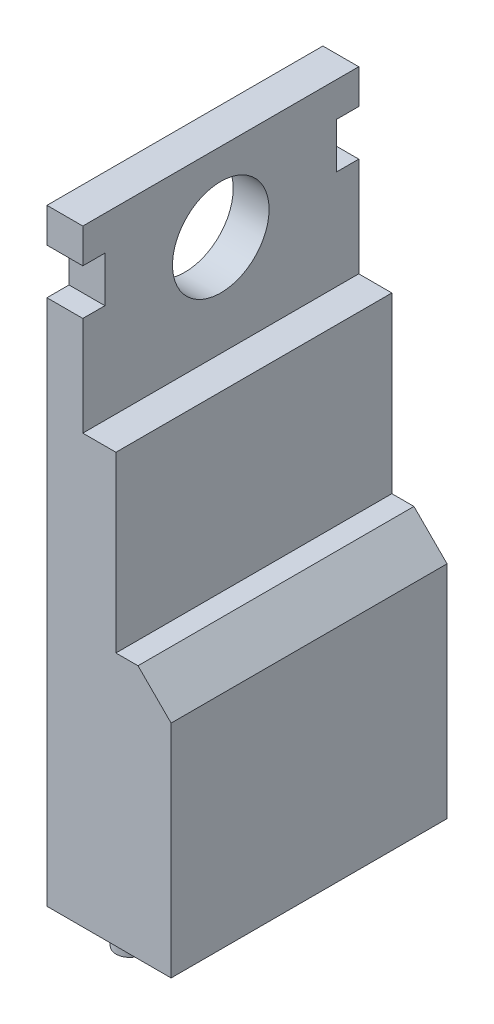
ISO-10303-21;
HEADER;
FILE_DESCRIPTION(('STEP AP214'),'2;1');
FILE_NAME('part.step','',(''),(''),'','','');
FILE_SCHEMA(('AUTOMOTIVE_DESIGN { 1 0 10303 214 1 1 1 1 }'));
ENDSEC;
DATA;
#1=APPLICATION_CONTEXT('core data for automotive mechanical design processes');
#2=APPLICATION_PROTOCOL_DEFINITION('international standard','automotive_design',2000,#1);
#3=PRODUCT_CONTEXT('',#1,'mechanical');
#4=PRODUCT('Part','Part','',(#3));
#5=PRODUCT_RELATED_PRODUCT_CATEGORY('part','',(#4));
#6=PRODUCT_DEFINITION_FORMATION('','',#4);
#7=PRODUCT_DEFINITION_CONTEXT('part definition',#1,'design');
#8=PRODUCT_DEFINITION('design','',#6,#7);
#9=PRODUCT_DEFINITION_SHAPE('','',#8);
#10=(LENGTH_UNIT() NAMED_UNIT(*) SI_UNIT(.MILLI.,.METRE.));
#11=(NAMED_UNIT(*) PLANE_ANGLE_UNIT() SI_UNIT($,.RADIAN.));
#12=(NAMED_UNIT(*) SI_UNIT($,.STERADIAN.) SOLID_ANGLE_UNIT());
#13=UNCERTAINTY_MEASURE_WITH_UNIT(LENGTH_MEASURE(1.E-05),#10,'distance_accuracy_value','');
#14=(GEOMETRIC_REPRESENTATION_CONTEXT(3) GLOBAL_UNCERTAINTY_ASSIGNED_CONTEXT((#13)) GLOBAL_UNIT_ASSIGNED_CONTEXT((#10,
#11,#12)) REPRESENTATION_CONTEXT('',''));
#15=CARTESIAN_POINT('',(0.,0.,0.));
#16=DIRECTION('',(0.,0.,1.));
#17=DIRECTION('',(1.,0.,0.));
#18=AXIS2_PLACEMENT_3D('',#15,#16,#17);
#19=CARTESIAN_POINT('',(1.3,19.15,0.));
#20=DIRECTION('',(-1.,0.,0.));
#21=DIRECTION('',(0.,0.,1.));
#22=AXIS2_PLACEMENT_3D('',#19,#20,#21);
#23=CYLINDRICAL_SURFACE('',#22,1.75);
#24=CARTESIAN_POINT('',(0.,19.15,0.));
#25=DIRECTION('',(1.,0.,0.));
#26=DIRECTION('',(0.,0.,-1.));
#27=AXIS2_PLACEMENT_3D('',#24,#25,#26);
#28=CIRCLE('',#27,1.75);
#29=CARTESIAN_POINT('',(0.,19.15,-1.75));
#30=VERTEX_POINT('',#29);
#31=EDGE_CURVE('E293',#30,#30,#28,.T.);
#32=ORIENTED_EDGE('',*,*,#31,.F.);
#33=EDGE_LOOP('',(#32));
#34=FACE_BOUND('',#33,.T.);
#35=CARTESIAN_POINT('',(1.3,19.15,0.));
#36=DIRECTION('',(1.,0.,0.));
#37=DIRECTION('',(0.,0.,-1.));
#38=AXIS2_PLACEMENT_3D('',#35,#36,#37);
#39=CIRCLE('',#38,1.75);
#40=CARTESIAN_POINT('',(1.3,19.15,-1.75));
#41=VERTEX_POINT('',#40);
#42=EDGE_CURVE('E11',#41,#41,#39,.T.);
#43=ORIENTED_EDGE('',*,*,#42,.T.);
#44=EDGE_LOOP('',(#43));
#45=FACE_BOUND('',#44,.T.);
#46=ADVANCED_FACE('F17',(#34,#45),#23,.F.);
#47=CARTESIAN_POINT('',(1.5,-1.25,-3.5));
#48=DIRECTION('',(0.,1.,0.));
#49=DIRECTION('',(-1.,0.,0.));
#50=AXIS2_PLACEMENT_3D('',#47,#48,#49);
#51=CYLINDRICAL_SURFACE('',#50,0.5);
#52=CARTESIAN_POINT('',(1.5,0.,-3.5));
#53=DIRECTION('',(0.,-1.,0.));
#54=DIRECTION('',(-1.,0.,0.));
#55=AXIS2_PLACEMENT_3D('',#52,#53,#54);
#56=CIRCLE('',#55,0.5);
#57=CARTESIAN_POINT('',(1.,0.,-3.5));
#58=VERTEX_POINT('',#57);
#59=EDGE_CURVE('E27',#58,#58,#56,.T.);
#60=ORIENTED_EDGE('',*,*,#59,.T.);
#61=EDGE_LOOP('',(#60));
#62=FACE_BOUND('',#61,.T.);
#63=CARTESIAN_POINT('',(1.5,-1.25,-3.5));
#64=DIRECTION('',(0.,-1.,0.));
#65=DIRECTION('',(-1.,0.,0.));
#66=AXIS2_PLACEMENT_3D('',#63,#64,#65);
#67=CIRCLE('',#66,0.5);
#68=CARTESIAN_POINT('',(1.,-1.25,-3.5));
#69=VERTEX_POINT('',#68);
#70=EDGE_CURVE('E215',#69,#69,#67,.T.);
#71=ORIENTED_EDGE('',*,*,#70,.F.);
#72=EDGE_LOOP('',(#71));
#73=FACE_BOUND('',#72,.T.);
#74=ADVANCED_FACE('F355',(#62,#73),#51,.T.);
#75=CARTESIAN_POINT('',(1.5,-1.25,3.5));
#76=DIRECTION('',(0.,1.,0.));
#77=DIRECTION('',(-1.,0.,0.));
#78=AXIS2_PLACEMENT_3D('',#75,#76,#77);
#79=CYLINDRICAL_SURFACE('',#78,0.5);
#80=CARTESIAN_POINT('',(1.5,0.,3.5));
#81=DIRECTION('',(0.,-1.,0.));
#82=DIRECTION('',(1.,0.,0.));
#83=AXIS2_PLACEMENT_3D('',#80,#81,#82);
#84=CIRCLE('',#83,0.5);
#85=CARTESIAN_POINT('',(2.,0.,3.5));
#86=VERTEX_POINT('',#85);
#87=EDGE_CURVE('E282',#86,#86,#84,.T.);
#88=ORIENTED_EDGE('',*,*,#87,.T.);
#89=EDGE_LOOP('',(#88));
#90=FACE_BOUND('',#89,.T.);
#91=CARTESIAN_POINT('',(1.5,-1.25,3.5));
#92=DIRECTION('',(0.,-1.,0.));
#93=DIRECTION('',(1.,0.,0.));
#94=AXIS2_PLACEMENT_3D('',#91,#92,#93);
#95=CIRCLE('',#94,0.5);
#96=CARTESIAN_POINT('',(2.,-1.25,3.5));
#97=VERTEX_POINT('',#96);
#98=EDGE_CURVE('E217',#97,#97,#95,.T.);
#99=ORIENTED_EDGE('',*,*,#98,.F.);
#100=EDGE_LOOP('',(#99));
#101=FACE_BOUND('',#100,.T.);
#102=ADVANCED_FACE('F353',(#90,#101),#79,.T.);
#103=CARTESIAN_POINT('',(0.,0.,-5.));
#104=DIRECTION('',(0.,0.,-1.));
#105=DIRECTION('',(-1.,0.,0.));
#106=AXIS2_PLACEMENT_3D('',#103,#104,#105);
#107=PLANE('',#106);
#108=DIRECTION('',(0.,-1.,0.));
#109=VECTOR('',#108,1.);
#110=CARTESIAN_POINT('',(0.,0.,-5.));
#111=LINE('',#110,#109);
#112=CARTESIAN_POINT('',(0.,19.1,-5.));
#113=VERTEX_POINT('',#112);
#114=CARTESIAN_POINT('',(0.,0.,-5.));
#115=VERTEX_POINT('',#114);
#116=EDGE_CURVE('E277',#113,#115,#111,.T.);
#117=ORIENTED_EDGE('',*,*,#116,.F.);
#118=DIRECTION('',(-1.,0.,0.));
#119=VECTOR('',#118,1.);
#120=CARTESIAN_POINT('',(1.3,19.1,-5.));
#121=LINE('',#120,#119);
#122=CARTESIAN_POINT('',(1.3,19.1,-5.));
#123=VERTEX_POINT('',#122);
#124=EDGE_CURVE('E188',#123,#113,#121,.T.);
#125=ORIENTED_EDGE('',*,*,#124,.F.);
#126=DIRECTION('',(0.,1.,0.));
#127=VECTOR('',#126,1.);
#128=CARTESIAN_POINT('',(1.3,15.5,-5.));
#129=LINE('',#128,#127);
#130=CARTESIAN_POINT('',(1.3,15.5,-5.));
#131=VERTEX_POINT('',#130);
#132=EDGE_CURVE('E193',#131,#123,#129,.T.);
#133=ORIENTED_EDGE('',*,*,#132,.F.);
#134=DIRECTION('',(-1.,0.,0.));
#135=VECTOR('',#134,1.);
#136=CARTESIAN_POINT('',(0.,15.5,-5.));
#137=LINE('',#136,#135);
#138=CARTESIAN_POINT('',(2.5,15.5,-5.));
#139=VERTEX_POINT('',#138);
#140=EDGE_CURVE('E291',#139,#131,#137,.T.);
#141=ORIENTED_EDGE('',*,*,#140,.F.);
#142=DIRECTION('',(0.,1.,0.));
#143=VECTOR('',#142,1.);
#144=CARTESIAN_POINT('',(2.5,15.5,-5.));
#145=LINE('',#144,#143);
#146=CARTESIAN_POINT('',(2.5,9.2,-5.));
#147=VERTEX_POINT('',#146);
#148=EDGE_CURVE('E197',#147,#139,#145,.T.);
#149=ORIENTED_EDGE('',*,*,#148,.F.);
#150=DIRECTION('',(-1.,0.,0.));
#151=VECTOR('',#150,1.);
#152=CARTESIAN_POINT('',(2.5,9.2,-5.));
#153=LINE('',#152,#151);
#154=CARTESIAN_POINT('',(3.3,9.2,-5.));
#155=VERTEX_POINT('',#154);
#156=EDGE_CURVE('E198',#155,#147,#153,.T.);
#157=ORIENTED_EDGE('',*,*,#156,.F.);
#158=DIRECTION('',(-0.707106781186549,0.707106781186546,0.));
#159=VECTOR('',#158,1.);
#160=CARTESIAN_POINT('',(3.3,9.2,-5.));
#161=LINE('',#160,#159);
#162=CARTESIAN_POINT('',(4.5,8.,-5.));
#163=VERTEX_POINT('',#162);
#164=EDGE_CURVE('E202',#163,#155,#161,.T.);
#165=ORIENTED_EDGE('',*,*,#164,.F.);
#166=DIRECTION('',(0.,1.,0.));
#167=VECTOR('',#166,1.);
#168=CARTESIAN_POINT('',(4.5,8.,-5.));
#169=LINE('',#168,#167);
#170=CARTESIAN_POINT('',(4.5,0.,-5.));
#171=VERTEX_POINT('',#170);
#172=EDGE_CURVE('E206',#171,#163,#169,.T.);
#173=ORIENTED_EDGE('',*,*,#172,.F.);
#174=DIRECTION('',(1.,0.,0.));
#175=VECTOR('',#174,1.);
#176=CARTESIAN_POINT('',(4.5,0.,-5.));
#177=LINE('',#176,#175);
#178=EDGE_CURVE('E279',#115,#171,#177,.T.);
#179=ORIENTED_EDGE('',*,*,#178,.F.);
#180=EDGE_LOOP('',(#117,#125,#133,#141,#149,#157,#165,#173,#179));
#181=FACE_BOUND('',#180,.T.);
#182=ADVANCED_FACE('F274',(#181),#107,.T.);
#183=CARTESIAN_POINT('',(0.,0.,-5.));
#184=DIRECTION('',(-1.,0.,0.));
#185=DIRECTION('',(0.,0.,1.));
#186=AXIS2_PLACEMENT_3D('',#183,#184,#185);
#187=PLANE('',#186);
#188=DIRECTION('',(0.,-1.,0.));
#189=VECTOR('',#188,1.);
#190=CARTESIAN_POINT('',(0.,0.,5.));
#191=LINE('',#190,#189);
#192=CARTESIAN_POINT('',(0.,19.1,5.));
#193=VERTEX_POINT('',#192);
#194=CARTESIAN_POINT('',(0.,0.,5.));
#195=VERTEX_POINT('',#194);
#196=EDGE_CURVE('E287',#193,#195,#191,.T.);
#197=ORIENTED_EDGE('',*,*,#196,.F.);
#198=DIRECTION('',(0.,0.,1.));
#199=VECTOR('',#198,1.);
#200=CARTESIAN_POINT('',(0.,19.1,5.));
#201=LINE('',#200,#199);
#202=CARTESIAN_POINT('',(0.,19.1,4.2));
#203=VERTEX_POINT('',#202);
#204=EDGE_CURVE('E156',#203,#193,#201,.T.);
#205=ORIENTED_EDGE('',*,*,#204,.F.);
#206=DIRECTION('',(0.,-1.,0.));
#207=VECTOR('',#206,1.);
#208=CARTESIAN_POINT('',(0.,20.75,4.2));
#209=LINE('',#208,#207);
#210=CARTESIAN_POINT('',(0.,20.75,4.2));
#211=VERTEX_POINT('',#210);
#212=EDGE_CURVE('E155',#211,#203,#209,.T.);
#213=ORIENTED_EDGE('',*,*,#212,.F.);
#214=DIRECTION('',(0.,0.,-1.));
#215=VECTOR('',#214,1.);
#216=CARTESIAN_POINT('',(0.,20.75,5.));
#217=LINE('',#216,#215);
#218=CARTESIAN_POINT('',(0.,20.75,5.));
#219=VERTEX_POINT('',#218);
#220=EDGE_CURVE('E165',#219,#211,#217,.T.);
#221=ORIENTED_EDGE('',*,*,#220,.F.);
#222=DIRECTION('',(0.,-1.,0.));
#223=VECTOR('',#222,1.);
#224=CARTESIAN_POINT('',(0.,20.75,5.));
#225=LINE('',#224,#223);
#226=CARTESIAN_POINT('',(0.,22.,5.));
#227=VERTEX_POINT('',#226);
#228=EDGE_CURVE('E169',#227,#219,#225,.T.);
#229=ORIENTED_EDGE('',*,*,#228,.F.);
#230=DIRECTION('',(0.,0.,1.));
#231=VECTOR('',#230,1.);
#232=CARTESIAN_POINT('',(0.,22.,5.));
#233=LINE('',#232,#231);
#234=CARTESIAN_POINT('',(0.,22.,-5.));
#235=VERTEX_POINT('',#234);
#236=EDGE_CURVE('E173',#235,#227,#233,.T.);
#237=ORIENTED_EDGE('',*,*,#236,.F.);
#238=DIRECTION('',(0.,1.,0.));
#239=VECTOR('',#238,1.);
#240=CARTESIAN_POINT('',(0.,20.75,-5.));
#241=LINE('',#240,#239);
#242=CARTESIAN_POINT('',(0.,20.75,-5.));
#243=VERTEX_POINT('',#242);
#244=EDGE_CURVE('E177',#243,#235,#241,.T.);
#245=ORIENTED_EDGE('',*,*,#244,.F.);
#246=DIRECTION('',(0.,0.,-1.));
#247=VECTOR('',#246,1.);
#248=CARTESIAN_POINT('',(0.,20.75,-5.));
#249=LINE('',#248,#247);
#250=CARTESIAN_POINT('',(0.,20.75,-4.2));
#251=VERTEX_POINT('',#250);
#252=EDGE_CURVE('E181',#251,#243,#249,.T.);
#253=ORIENTED_EDGE('',*,*,#252,.F.);
#254=DIRECTION('',(0.,1.,0.));
#255=VECTOR('',#254,1.);
#256=CARTESIAN_POINT('',(0.,20.75,-4.2));
#257=LINE('',#256,#255);
#258=CARTESIAN_POINT('',(0.,19.1,-4.2));
#259=VERTEX_POINT('',#258);
#260=EDGE_CURVE('E185',#259,#251,#257,.T.);
#261=ORIENTED_EDGE('',*,*,#260,.F.);
#262=DIRECTION('',(0.,0.,1.));
#263=VECTOR('',#262,1.);
#264=CARTESIAN_POINT('',(0.,19.1,-5.));
#265=LINE('',#264,#263);
#266=EDGE_CURVE('E145',#113,#259,#265,.T.);
#267=ORIENTED_EDGE('',*,*,#266,.F.);
#268=ORIENTED_EDGE('',*,*,#116,.T.);
#269=DIRECTION('',(0.,0.,1.));
#270=VECTOR('',#269,1.);
#271=CARTESIAN_POINT('',(0.,0.,-5.));
#272=LINE('',#271,#270);
#273=EDGE_CURVE('E283',#115,#195,#272,.T.);
#274=ORIENTED_EDGE('',*,*,#273,.T.);
#275=EDGE_LOOP('',(#197,#205,#213,#221,#229,#237,#245,#253,#261,#267,#268,#274));
#276=FACE_BOUND('',#275,.T.);
#277=ORIENTED_EDGE('',*,*,#31,.T.);
#278=EDGE_LOOP('',(#277));
#279=FACE_BOUND('',#278,.T.);
#280=ADVANCED_FACE('F253',(#276,#279),#187,.T.);
#281=CARTESIAN_POINT('',(0.,0.,5.));
#282=DIRECTION('',(0.,0.,-1.));
#283=DIRECTION('',(-1.,0.,0.));
#284=AXIS2_PLACEMENT_3D('',#281,#282,#283);
#285=PLANE('',#284);
#286=DIRECTION('',(-1.,0.,0.));
#287=VECTOR('',#286,1.);
#288=CARTESIAN_POINT('',(0.,15.5,5.));
#289=LINE('',#288,#287);
#290=CARTESIAN_POINT('',(2.5,15.5,5.));
#291=VERTEX_POINT('',#290);
#292=CARTESIAN_POINT('',(1.3,15.5,5.));
#293=VERTEX_POINT('',#292);
#294=EDGE_CURVE('E299',#291,#293,#289,.T.);
#295=ORIENTED_EDGE('',*,*,#294,.T.);
#296=DIRECTION('',(0.,-1.,0.));
#297=VECTOR('',#296,1.);
#298=CARTESIAN_POINT('',(1.3,15.5,5.));
#299=LINE('',#298,#297);
#300=CARTESIAN_POINT('',(1.3,19.1,5.));
#301=VERTEX_POINT('',#300);
#302=EDGE_CURVE('E192',#301,#293,#299,.T.);
#303=ORIENTED_EDGE('',*,*,#302,.F.);
#304=DIRECTION('',(-1.,0.,0.));
#305=VECTOR('',#304,1.);
#306=CARTESIAN_POINT('',(1.3,19.1,5.));
#307=LINE('',#306,#305);
#308=EDGE_CURVE('E144',#301,#193,#307,.T.);
#309=ORIENTED_EDGE('',*,*,#308,.T.);
#310=ORIENTED_EDGE('',*,*,#196,.T.);
#311=DIRECTION('',(1.,0.,0.));
#312=VECTOR('',#311,1.);
#313=CARTESIAN_POINT('',(4.5,0.,5.));
#314=LINE('',#313,#312);
#315=CARTESIAN_POINT('',(4.5,0.,5.));
#316=VERTEX_POINT('',#315);
#317=EDGE_CURVE('E300',#195,#316,#314,.T.);
#318=ORIENTED_EDGE('',*,*,#317,.T.);
#319=DIRECTION('',(0.,1.,0.));
#320=VECTOR('',#319,1.);
#321=CARTESIAN_POINT('',(4.5,8.,5.));
#322=LINE('',#321,#320);
#323=CARTESIAN_POINT('',(4.5,8.,5.));
#324=VERTEX_POINT('',#323);
#325=EDGE_CURVE('E304',#316,#324,#322,.T.);
#326=ORIENTED_EDGE('',*,*,#325,.T.);
#327=DIRECTION('',(-0.707106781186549,0.707106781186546,0.));
#328=VECTOR('',#327,1.);
#329=CARTESIAN_POINT('',(3.3,9.2,5.));
#330=LINE('',#329,#328);
#331=CARTESIAN_POINT('',(3.3,9.2,5.));
#332=VERTEX_POINT('',#331);
#333=EDGE_CURVE('E307',#324,#332,#330,.T.);
#334=ORIENTED_EDGE('',*,*,#333,.T.);
#335=DIRECTION('',(-1.,0.,0.));
#336=VECTOR('',#335,1.);
#337=CARTESIAN_POINT('',(2.5,9.2,5.));
#338=LINE('',#337,#336);
#339=CARTESIAN_POINT('',(2.5,9.2,5.));
#340=VERTEX_POINT('',#339);
#341=EDGE_CURVE('E310',#332,#340,#338,.T.);
#342=ORIENTED_EDGE('',*,*,#341,.T.);
#343=DIRECTION('',(0.,1.,0.));
#344=VECTOR('',#343,1.);
#345=CARTESIAN_POINT('',(2.5,15.5,5.));
#346=LINE('',#345,#344);
#347=EDGE_CURVE('E313',#340,#291,#346,.T.);
#348=ORIENTED_EDGE('',*,*,#347,.T.);
#349=EDGE_LOOP('',(#295,#303,#309,#310,#318,#326,#334,#342,#348));
#350=FACE_BOUND('',#349,.T.);
#351=ADVANCED_FACE('F317',(#350),#285,.F.);
#352=CARTESIAN_POINT('',(4.5,0.,-5.));
#353=DIRECTION('',(0.,-1.,0.));
#354=DIRECTION('',(1.,0.,0.));
#355=AXIS2_PLACEMENT_3D('',#352,#353,#354);
#356=PLANE('',#355);
#357=ORIENTED_EDGE('',*,*,#87,.F.);
#358=EDGE_LOOP('',(#357));
#359=FACE_BOUND('',#358,.T.);
#360=ORIENTED_EDGE('',*,*,#317,.F.);
#361=ORIENTED_EDGE('',*,*,#273,.F.);
#362=ORIENTED_EDGE('',*,*,#178,.T.);
#363=DIRECTION('',(0.,0.,1.));
#364=VECTOR('',#363,1.);
#365=CARTESIAN_POINT('',(4.5,0.,-5.));
#366=LINE('',#365,#364);
#367=EDGE_CURVE('E161',#171,#316,#366,.T.);
#368=ORIENTED_EDGE('',*,*,#367,.T.);
#369=EDGE_LOOP('',(#360,#361,#362,#368));
#370=FACE_BOUND('',#369,.T.);
#371=ORIENTED_EDGE('',*,*,#59,.F.);
#372=EDGE_LOOP('',(#371));
#373=FACE_BOUND('',#372,.T.);
#374=ADVANCED_FACE('F338',(#359,#370,#373),#356,.T.);
#375=CARTESIAN_POINT('',(0.,15.5,-5.));
#376=DIRECTION('',(0.,1.,0.));
#377=DIRECTION('',(0.,0.,1.));
#378=AXIS2_PLACEMENT_3D('',#375,#376,#377);
#379=PLANE('',#378);
#380=DIRECTION('',(0.,0.,-1.));
#381=VECTOR('',#380,1.);
#382=CARTESIAN_POINT('',(1.3,15.5,5.));
#383=LINE('',#382,#381);
#384=EDGE_CURVE('E36',#293,#131,#383,.T.);
#385=ORIENTED_EDGE('',*,*,#384,.F.);
#386=ORIENTED_EDGE('',*,*,#294,.F.);
#387=DIRECTION('',(0.,0.,1.));
#388=VECTOR('',#387,1.);
#389=CARTESIAN_POINT('',(2.5,15.5,-5.));
#390=LINE('',#389,#388);
#391=EDGE_CURVE('E194',#139,#291,#390,.T.);
#392=ORIENTED_EDGE('',*,*,#391,.F.);
#393=ORIENTED_EDGE('',*,*,#140,.T.);
#394=EDGE_LOOP('',(#385,#386,#392,#393));
#395=FACE_BOUND('',#394,.T.);
#396=ADVANCED_FACE('F320',(#395),#379,.T.);
#397=CARTESIAN_POINT('',(2.5,15.5,-5.));
#398=DIRECTION('',(1.,0.,0.));
#399=DIRECTION('',(0.,1.,0.));
#400=AXIS2_PLACEMENT_3D('',#397,#398,#399);
#401=PLANE('',#400);
#402=ORIENTED_EDGE('',*,*,#347,.F.);
#403=DIRECTION('',(0.,0.,1.));
#404=VECTOR('',#403,1.);
#405=CARTESIAN_POINT('',(2.5,9.2,-5.));
#406=LINE('',#405,#404);
#407=EDGE_CURVE('E199',#147,#340,#406,.T.);
#408=ORIENTED_EDGE('',*,*,#407,.F.);
#409=ORIENTED_EDGE('',*,*,#148,.T.);
#410=ORIENTED_EDGE('',*,*,#391,.T.);
#411=EDGE_LOOP('',(#402,#408,#409,#410));
#412=FACE_BOUND('',#411,.T.);
#413=ADVANCED_FACE('F327',(#412),#401,.T.);
#414=CARTESIAN_POINT('',(2.5,9.2,-5.));
#415=DIRECTION('',(0.,1.,0.));
#416=DIRECTION('',(0.,0.,1.));
#417=AXIS2_PLACEMENT_3D('',#414,#415,#416);
#418=PLANE('',#417);
#419=ORIENTED_EDGE('',*,*,#341,.F.);
#420=DIRECTION('',(0.,0.,1.));
#421=VECTOR('',#420,1.);
#422=CARTESIAN_POINT('',(3.3,9.2,-5.));
#423=LINE('',#422,#421);
#424=EDGE_CURVE('E203',#155,#332,#423,.T.);
#425=ORIENTED_EDGE('',*,*,#424,.F.);
#426=ORIENTED_EDGE('',*,*,#156,.T.);
#427=ORIENTED_EDGE('',*,*,#407,.T.);
#428=EDGE_LOOP('',(#419,#425,#426,#427));
#429=FACE_BOUND('',#428,.T.);
#430=ADVANCED_FACE('F329',(#429),#418,.T.);
#431=CARTESIAN_POINT('',(3.3,9.2,-5.));
#432=DIRECTION('',(0.707106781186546,0.707106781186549,0.));
#433=DIRECTION('',(-0.707106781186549,0.707106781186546,0.));
#434=AXIS2_PLACEMENT_3D('',#431,#432,#433);
#435=PLANE('',#434);
#436=ORIENTED_EDGE('',*,*,#333,.F.);
#437=DIRECTION('',(0.,0.,1.));
#438=VECTOR('',#437,1.);
#439=CARTESIAN_POINT('',(4.5,8.,-5.));
#440=LINE('',#439,#438);
#441=EDGE_CURVE('E207',#163,#324,#440,.T.);
#442=ORIENTED_EDGE('',*,*,#441,.F.);
#443=ORIENTED_EDGE('',*,*,#164,.T.);
#444=ORIENTED_EDGE('',*,*,#424,.T.);
#445=EDGE_LOOP('',(#436,#442,#443,#444));
#446=FACE_BOUND('',#445,.T.);
#447=ADVANCED_FACE('F331',(#446),#435,.T.);
#448=CARTESIAN_POINT('',(4.5,8.,-5.));
#449=DIRECTION('',(1.,0.,0.));
#450=DIRECTION('',(0.,1.,0.));
#451=AXIS2_PLACEMENT_3D('',#448,#449,#450);
#452=PLANE('',#451);
#453=ORIENTED_EDGE('',*,*,#325,.F.);
#454=ORIENTED_EDGE('',*,*,#367,.F.);
#455=ORIENTED_EDGE('',*,*,#172,.T.);
#456=ORIENTED_EDGE('',*,*,#441,.T.);
#457=EDGE_LOOP('',(#453,#454,#455,#456));
#458=FACE_BOUND('',#457,.T.);
#459=ADVANCED_FACE('F340',(#458),#452,.T.);
#460=CARTESIAN_POINT('',(1.5,-1.25,3.5));
#461=DIRECTION('',(0.,-1.,0.));
#462=DIRECTION('',(1.,0.,0.));
#463=AXIS2_PLACEMENT_3D('',#460,#461,#462);
#464=PLANE('',#463);
#465=ORIENTED_EDGE('',*,*,#98,.T.);
#466=EDGE_LOOP('',(#465));
#467=FACE_BOUND('',#466,.T.);
#468=ADVANCED_FACE('F351',(#467),#464,.T.);
#469=CARTESIAN_POINT('',(1.5,-1.25,-3.5));
#470=DIRECTION('',(0.,1.,0.));
#471=DIRECTION('',(-1.,0.,0.));
#472=AXIS2_PLACEMENT_3D('',#469,#470,#471);
#473=PLANE('',#472);
#474=ORIENTED_EDGE('',*,*,#70,.T.);
#475=EDGE_LOOP('',(#474));
#476=FACE_BOUND('',#475,.T.);
#477=ADVANCED_FACE('F374',(#476),#473,.F.);
#478=CARTESIAN_POINT('',(1.3,19.1,5.));
#479=DIRECTION('',(-1.,0.,0.));
#480=DIRECTION('',(0.,0.,1.));
#481=AXIS2_PLACEMENT_3D('',#478,#479,#480);
#482=PLANE('',#481);
#483=ORIENTED_EDGE('',*,*,#302,.T.);
#484=ORIENTED_EDGE('',*,*,#384,.T.);
#485=ORIENTED_EDGE('',*,*,#132,.T.);
#486=DIRECTION('',(0.,0.,1.));
#487=VECTOR('',#486,1.);
#488=CARTESIAN_POINT('',(1.3,19.1,-5.));
#489=LINE('',#488,#487);
#490=CARTESIAN_POINT('',(1.3,19.1,-4.2));
#491=VERTEX_POINT('',#490);
#492=EDGE_CURVE('E213',#123,#491,#489,.T.);
#493=ORIENTED_EDGE('',*,*,#492,.T.);
#494=DIRECTION('',(0.,1.,0.));
#495=VECTOR('',#494,1.);
#496=CARTESIAN_POINT('',(1.3,20.75,-4.2));
#497=LINE('',#496,#495);
#498=CARTESIAN_POINT('',(1.3,20.75,-4.2));
#499=VERTEX_POINT('',#498);
#500=EDGE_CURVE('E220',#491,#499,#497,.T.);
#501=ORIENTED_EDGE('',*,*,#500,.T.);
#502=DIRECTION('',(0.,0.,-1.));
#503=VECTOR('',#502,1.);
#504=CARTESIAN_POINT('',(1.3,20.75,-5.));
#505=LINE('',#504,#503);
#506=CARTESIAN_POINT('',(1.3,20.75,-5.));
#507=VERTEX_POINT('',#506);
#508=EDGE_CURVE('E223',#499,#507,#505,.T.);
#509=ORIENTED_EDGE('',*,*,#508,.T.);
#510=DIRECTION('',(0.,1.,0.));
#511=VECTOR('',#510,1.);
#512=CARTESIAN_POINT('',(1.3,20.75,-5.));
#513=LINE('',#512,#511);
#514=CARTESIAN_POINT('',(1.3,22.,-5.));
#515=VERTEX_POINT('',#514);
#516=EDGE_CURVE('E226',#507,#515,#513,.T.);
#517=ORIENTED_EDGE('',*,*,#516,.T.);
#518=DIRECTION('',(0.,0.,1.));
#519=VECTOR('',#518,1.);
#520=CARTESIAN_POINT('',(1.3,22.,5.));
#521=LINE('',#520,#519);
#522=CARTESIAN_POINT('',(1.3,22.,5.));
#523=VERTEX_POINT('',#522);
#524=EDGE_CURVE('E229',#515,#523,#521,.T.);
#525=ORIENTED_EDGE('',*,*,#524,.T.);
#526=DIRECTION('',(0.,-1.,0.));
#527=VECTOR('',#526,1.);
#528=CARTESIAN_POINT('',(1.3,20.75,5.));
#529=LINE('',#528,#527);
#530=CARTESIAN_POINT('',(1.3,20.75,5.));
#531=VERTEX_POINT('',#530);
#532=EDGE_CURVE('E232',#523,#531,#529,.T.);
#533=ORIENTED_EDGE('',*,*,#532,.T.);
#534=DIRECTION('',(0.,0.,-1.));
#535=VECTOR('',#534,1.);
#536=CARTESIAN_POINT('',(1.3,20.75,5.));
#537=LINE('',#536,#535);
#538=CARTESIAN_POINT('',(1.3,20.75,4.2));
#539=VERTEX_POINT('',#538);
#540=EDGE_CURVE('E150',#531,#539,#537,.T.);
#541=ORIENTED_EDGE('',*,*,#540,.T.);
#542=DIRECTION('',(0.,-1.,0.));
#543=VECTOR('',#542,1.);
#544=CARTESIAN_POINT('',(1.3,20.75,4.2));
#545=LINE('',#544,#543);
#546=CARTESIAN_POINT('',(1.3,19.1,4.2));
#547=VERTEX_POINT('',#546);
#548=EDGE_CURVE('E134',#539,#547,#545,.T.);
#549=ORIENTED_EDGE('',*,*,#548,.T.);
#550=DIRECTION('',(0.,0.,1.));
#551=VECTOR('',#550,1.);
#552=CARTESIAN_POINT('',(1.3,19.1,5.));
#553=LINE('',#552,#551);
#554=EDGE_CURVE('E141',#547,#301,#553,.T.);
#555=ORIENTED_EDGE('',*,*,#554,.T.);
#556=EDGE_LOOP('',(#483,#484,#485,#493,#501,#509,#517,#525,#533,#541,#549,#555));
#557=FACE_BOUND('',#556,.T.);
#558=ORIENTED_EDGE('',*,*,#42,.F.);
#559=EDGE_LOOP('',(#558));
#560=FACE_BOUND('',#559,.T.);
#561=ADVANCED_FACE('F147',(#557,#560),#482,.F.);
#562=CARTESIAN_POINT('',(1.3,19.1,-5.));
#563=DIRECTION('',(0.,-1.,0.));
#564=DIRECTION('',(0.,0.,-1.));
#565=AXIS2_PLACEMENT_3D('',#562,#563,#564);
#566=PLANE('',#565);
#567=ORIENTED_EDGE('',*,*,#266,.T.);
#568=DIRECTION('',(-1.,0.,0.));
#569=VECTOR('',#568,1.);
#570=CARTESIAN_POINT('',(1.3,19.1,-4.2));
#571=LINE('',#570,#569);
#572=EDGE_CURVE('E184',#491,#259,#571,.T.);
#573=ORIENTED_EDGE('',*,*,#572,.F.);
#574=ORIENTED_EDGE('',*,*,#492,.F.);
#575=ORIENTED_EDGE('',*,*,#124,.T.);
#576=EDGE_LOOP('',(#567,#573,#574,#575));
#577=FACE_BOUND('',#576,.T.);
#578=ADVANCED_FACE('F270',(#577),#566,.F.);
#579=CARTESIAN_POINT('',(1.3,20.75,-4.2));
#580=DIRECTION('',(0.,0.,1.));
#581=DIRECTION('',(1.,0.,0.));
#582=AXIS2_PLACEMENT_3D('',#579,#580,#581);
#583=PLANE('',#582);
#584=ORIENTED_EDGE('',*,*,#260,.T.);
#585=DIRECTION('',(-1.,0.,0.));
#586=VECTOR('',#585,1.);
#587=CARTESIAN_POINT('',(1.3,20.75,-4.2));
#588=LINE('',#587,#586);
#589=EDGE_CURVE('E180',#499,#251,#588,.T.);
#590=ORIENTED_EDGE('',*,*,#589,.F.);
#591=ORIENTED_EDGE('',*,*,#500,.F.);
#592=ORIENTED_EDGE('',*,*,#572,.T.);
#593=EDGE_LOOP('',(#584,#590,#591,#592));
#594=FACE_BOUND('',#593,.T.);
#595=ADVANCED_FACE('F265',(#594),#583,.F.);
#596=CARTESIAN_POINT('',(1.3,20.75,-5.));
#597=DIRECTION('',(0.,1.,0.));
#598=DIRECTION('',(0.,0.,1.));
#599=AXIS2_PLACEMENT_3D('',#596,#597,#598);
#600=PLANE('',#599);
#601=ORIENTED_EDGE('',*,*,#252,.T.);
#602=DIRECTION('',(-1.,0.,0.));
#603=VECTOR('',#602,1.);
#604=CARTESIAN_POINT('',(1.3,20.75,-5.));
#605=LINE('',#604,#603);
#606=EDGE_CURVE('E176',#507,#243,#605,.T.);
#607=ORIENTED_EDGE('',*,*,#606,.F.);
#608=ORIENTED_EDGE('',*,*,#508,.F.);
#609=ORIENTED_EDGE('',*,*,#589,.T.);
#610=EDGE_LOOP('',(#601,#607,#608,#609));
#611=FACE_BOUND('',#610,.T.);
#612=ADVANCED_FACE('F262',(#611),#600,.F.);
#613=CARTESIAN_POINT('',(1.3,20.75,-5.));
#614=DIRECTION('',(0.,0.,1.));
#615=DIRECTION('',(0.,-1.,0.));
#616=AXIS2_PLACEMENT_3D('',#613,#614,#615);
#617=PLANE('',#616);
#618=ORIENTED_EDGE('',*,*,#244,.T.);
#619=DIRECTION('',(-1.,0.,0.));
#620=VECTOR('',#619,1.);
#621=CARTESIAN_POINT('',(1.3,22.,-5.));
#622=LINE('',#621,#620);
#623=EDGE_CURVE('E172',#515,#235,#622,.T.);
#624=ORIENTED_EDGE('',*,*,#623,.F.);
#625=ORIENTED_EDGE('',*,*,#516,.F.);
#626=ORIENTED_EDGE('',*,*,#606,.T.);
#627=EDGE_LOOP('',(#618,#624,#625,#626));
#628=FACE_BOUND('',#627,.T.);
#629=ADVANCED_FACE('F259',(#628),#617,.F.);
#630=CARTESIAN_POINT('',(1.3,22.,5.));
#631=DIRECTION('',(0.,-1.,0.));
#632=DIRECTION('',(0.,0.,-1.));
#633=AXIS2_PLACEMENT_3D('',#630,#631,#632);
#634=PLANE('',#633);
#635=ORIENTED_EDGE('',*,*,#236,.T.);
#636=DIRECTION('',(-1.,0.,0.));
#637=VECTOR('',#636,1.);
#638=CARTESIAN_POINT('',(1.3,22.,5.));
#639=LINE('',#638,#637);
#640=EDGE_CURVE('E168',#523,#227,#639,.T.);
#641=ORIENTED_EDGE('',*,*,#640,.F.);
#642=ORIENTED_EDGE('',*,*,#524,.F.);
#643=ORIENTED_EDGE('',*,*,#623,.T.);
#644=EDGE_LOOP('',(#635,#641,#642,#643));
#645=FACE_BOUND('',#644,.T.);
#646=ADVANCED_FACE('F256',(#645),#634,.F.);
#647=CARTESIAN_POINT('',(1.3,20.75,5.));
#648=DIRECTION('',(0.,0.,-1.));
#649=DIRECTION('',(0.,1.,0.));
#650=AXIS2_PLACEMENT_3D('',#647,#648,#649);
#651=PLANE('',#650);
#652=ORIENTED_EDGE('',*,*,#228,.T.);
#653=DIRECTION('',(-1.,0.,0.));
#654=VECTOR('',#653,1.);
#655=CARTESIAN_POINT('',(1.3,20.75,5.));
#656=LINE('',#655,#654);
#657=EDGE_CURVE('E164',#531,#219,#656,.T.);
#658=ORIENTED_EDGE('',*,*,#657,.F.);
#659=ORIENTED_EDGE('',*,*,#532,.F.);
#660=ORIENTED_EDGE('',*,*,#640,.T.);
#661=EDGE_LOOP('',(#652,#658,#659,#660));
#662=FACE_BOUND('',#661,.T.);
#663=ADVANCED_FACE('F250',(#662),#651,.F.);
#664=CARTESIAN_POINT('',(1.3,20.75,5.));
#665=DIRECTION('',(0.,1.,0.));
#666=DIRECTION('',(0.,0.,1.));
#667=AXIS2_PLACEMENT_3D('',#664,#665,#666);
#668=PLANE('',#667);
#669=ORIENTED_EDGE('',*,*,#220,.T.);
#670=DIRECTION('',(-1.,0.,0.));
#671=VECTOR('',#670,1.);
#672=CARTESIAN_POINT('',(1.3,20.75,4.2));
#673=LINE('',#672,#671);
#674=EDGE_CURVE('E157',#539,#211,#673,.T.);
#675=ORIENTED_EDGE('',*,*,#674,.F.);
#676=ORIENTED_EDGE('',*,*,#540,.F.);
#677=ORIENTED_EDGE('',*,*,#657,.T.);
#678=EDGE_LOOP('',(#669,#675,#676,#677));
#679=FACE_BOUND('',#678,.T.);
#680=ADVANCED_FACE('F248',(#679),#668,.F.);
#681=CARTESIAN_POINT('',(1.3,20.75,4.2));
#682=DIRECTION('',(0.,0.,-1.));
#683=DIRECTION('',(-1.,0.,0.));
#684=AXIS2_PLACEMENT_3D('',#681,#682,#683);
#685=PLANE('',#684);
#686=ORIENTED_EDGE('',*,*,#212,.T.);
#687=DIRECTION('',(-1.,0.,0.));
#688=VECTOR('',#687,1.);
#689=CARTESIAN_POINT('',(1.3,19.1,4.2));
#690=LINE('',#689,#688);
#691=EDGE_CURVE('E21',#547,#203,#690,.T.);
#692=ORIENTED_EDGE('',*,*,#691,.F.);
#693=ORIENTED_EDGE('',*,*,#548,.F.);
#694=ORIENTED_EDGE('',*,*,#674,.T.);
#695=EDGE_LOOP('',(#686,#692,#693,#694));
#696=FACE_BOUND('',#695,.T.);
#697=ADVANCED_FACE('F154',(#696),#685,.F.);
#698=CARTESIAN_POINT('',(1.3,19.1,5.));
#699=DIRECTION('',(0.,-1.,0.));
#700=DIRECTION('',(0.,0.,-1.));
#701=AXIS2_PLACEMENT_3D('',#698,#699,#700);
#702=PLANE('',#701);
#703=ORIENTED_EDGE('',*,*,#204,.T.);
#704=ORIENTED_EDGE('',*,*,#308,.F.);
#705=ORIENTED_EDGE('',*,*,#554,.F.);
#706=ORIENTED_EDGE('',*,*,#691,.T.);
#707=EDGE_LOOP('',(#703,#704,#705,#706));
#708=FACE_BOUND('',#707,.T.);
#709=ADVANCED_FACE('F19',(#708),#702,.F.);
#710=CLOSED_SHELL('',(#46,#74,#102,#182,#280,#351,#374,#396,#413,#430,#447,#459,#468,#477,#561,
#578,#595,#612,#629,#646,#663,#680,#697,#709));
#711=MANIFOLD_SOLID_BREP('B1',#710);
#712=ADVANCED_BREP_SHAPE_REPRESENTATION('',(#18,#711),#14);
#713=SHAPE_DEFINITION_REPRESENTATION(#9,#712);
ENDSEC;
END-ISO-10303-21;
